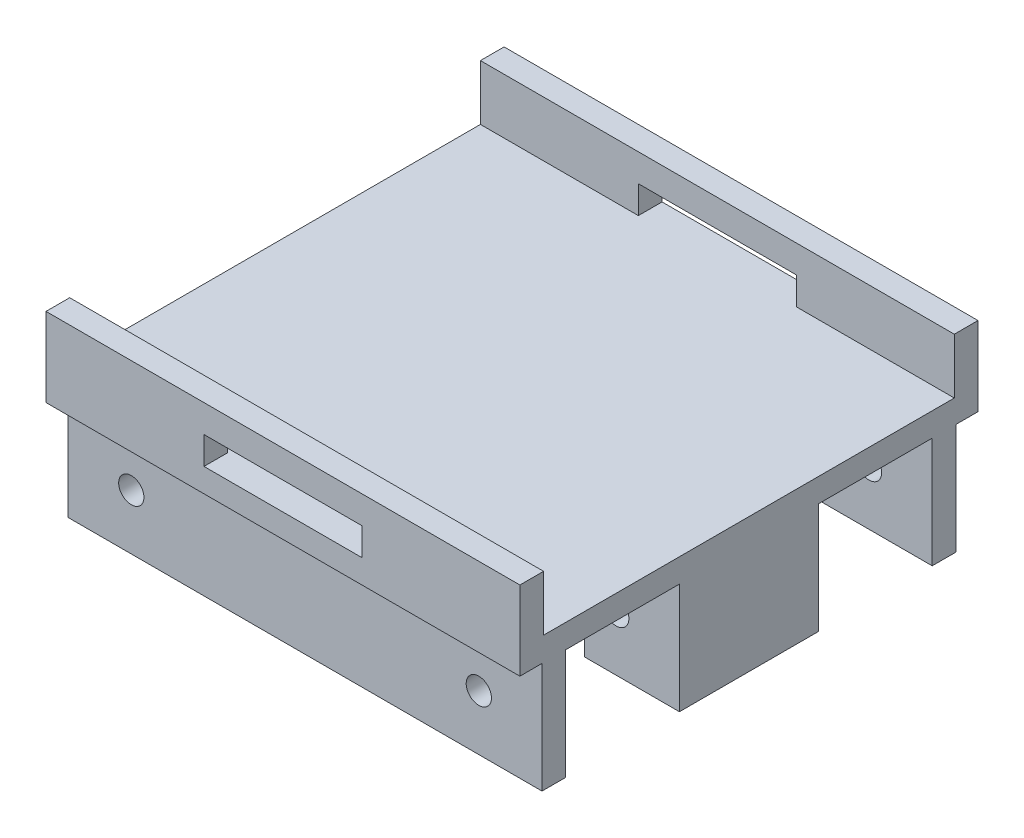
from build123d import *

# Parameters (mm, degrees)
SKETCH_1_W               = 3
SKETCH_1_H               = 7
SKETCH_1_H_2             = 14
EXTRUDE_1_DEPTH          = 60
SKETCH_2_W               = 3
SKETCH_2_H               = 11.6
EXTRUDE_2_DEPTH          = 14
SKETCH_2_3_W             = 36
SKETCH_2_3_H             = 3
CUT_EXTRUDE_1_DEPTH      = 14
SKETCH_4_R               = 1.6
CUT_EXTRUDE_2_DEPTH      = 83.540742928
CUT_EXTRUDE_3_DEPTH      = 83.407124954
CUT_EXTRUDE_3_DEPTH_BACK = 83.407124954
SKETCH_5_W               = 10
SKETCH_5_H               = 3
CHAMFER_1_SIZE           = 0.5


with BuildPart() as part:
    # Sketch 1 → Extrude 1 (new body)
    with BuildSketch(Plane(origin=(0, 0, 0), x_dir=(0, 0, -1), z_dir=(1, 0, 0))):
        Polygon((-70.743167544, 1.118453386), (-67.943167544, 1.118453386), (-64.943167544, 1.118453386), (-50.543167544, 1.118453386), (-47.543167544, 1.118453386), (-35.943167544, 1.118453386), (-32.943167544, 1.118453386), (-18.543167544, 1.118453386), (-15.543167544, 1.118453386), (-12.743167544, 1.118453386), (-12.743167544, 4.118453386), (-15.743167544, 4.118453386), (-67.743167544, 4.118453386), (-70.743167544, 4.118453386), align=None)
        with Locations((-69.243167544, 7.618453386)):
            Rectangle(SKETCH_1_W, SKETCH_1_H)
        with Locations((-66.443167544, -5.881546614)):
            Rectangle(SKETCH_1_W, SKETCH_1_H_2)
        with Locations((-49.043167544, -5.881546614)):
            Rectangle(SKETCH_1_W, SKETCH_1_H_2)
        with Locations((-34.443167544, -5.881546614)):
            Rectangle(SKETCH_1_W, SKETCH_1_H_2)
        with Locations((-17.043167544, -5.881546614)):
            Rectangle(SKETCH_1_W, SKETCH_1_H_2)
        with Locations((-14.243167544, 7.618453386)):
            Rectangle(SKETCH_1_W, SKETCH_1_H)
    extrude(amount=EXTRUDE_1_DEPTH)

    # Sketch 2 → Extrude 2 (add)
    with BuildSketch(Plane.XZ.offset(12.881546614)):
        with Locations((1.5, 41.743167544)):
            Rectangle(SKETCH_2_W, SKETCH_2_H)
        with Locations((58.5, 41.743167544)):
            Rectangle(SKETCH_2_W, SKETCH_2_H)
    extrude(amount=-EXTRUDE_2_DEPTH)

    # Sketch 2_3 → Cut-Extrude 1 (cut)
    with BuildSketch(Plane.XZ.offset(12.881546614)):
        with Locations((30, 49.043167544)):
            Rectangle(SKETCH_2_3_W, SKETCH_2_3_H)
        with Locations((30, 34.443167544)):
            Rectangle(SKETCH_2_3_W, SKETCH_2_3_H)
    extrude(amount=-CUT_EXTRUDE_1_DEPTH, mode=Mode.SUBTRACT)

    # Sketch 4 → Cut-Extrude 2 (cut, through all)
    with BuildSketch(Plane.XY.offset(67.943167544)):
        with Locations((8, -5.881546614)):
            Circle(SKETCH_4_R)
        with Locations((52, -5.881546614)):
            Circle(SKETCH_4_R)
    extrude(amount=-CUT_EXTRUDE_2_DEPTH, mode=Mode.SUBTRACT)

    # Sketch 5 → Cut-Extrude 3 (cut, two sides: drawn at the far end of the back side and taken through both)
    with BuildSketch(Plane.XY.offset(15.743167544).offset(-CUT_EXTRUDE_3_DEPTH_BACK)):
        with Locations((25, 5.618453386)):
            Rectangle(SKETCH_5_W, SKETCH_5_H)
        with Locations((35, 5.618453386)):
            Rectangle(SKETCH_5_W, SKETCH_5_H)
    extrude(amount=CUT_EXTRUDE_3_DEPTH + CUT_EXTRUDE_3_DEPTH_BACK, mode=Mode.SUBTRACT)

    # Chamfer 1
    chamfer_1_edges = [part.edges().sort_by_distance(p)[0] for p in [
        (30, 7.118453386, 67.743167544),
        (30, 7.118453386, 70.743167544),
        (30, 7.118453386, 15.743167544),
        (30, 7.118453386, 12.743167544),
    ]]
    chamfer(chamfer_1_edges, length=CHAMFER_1_SIZE)


solid = part.part
